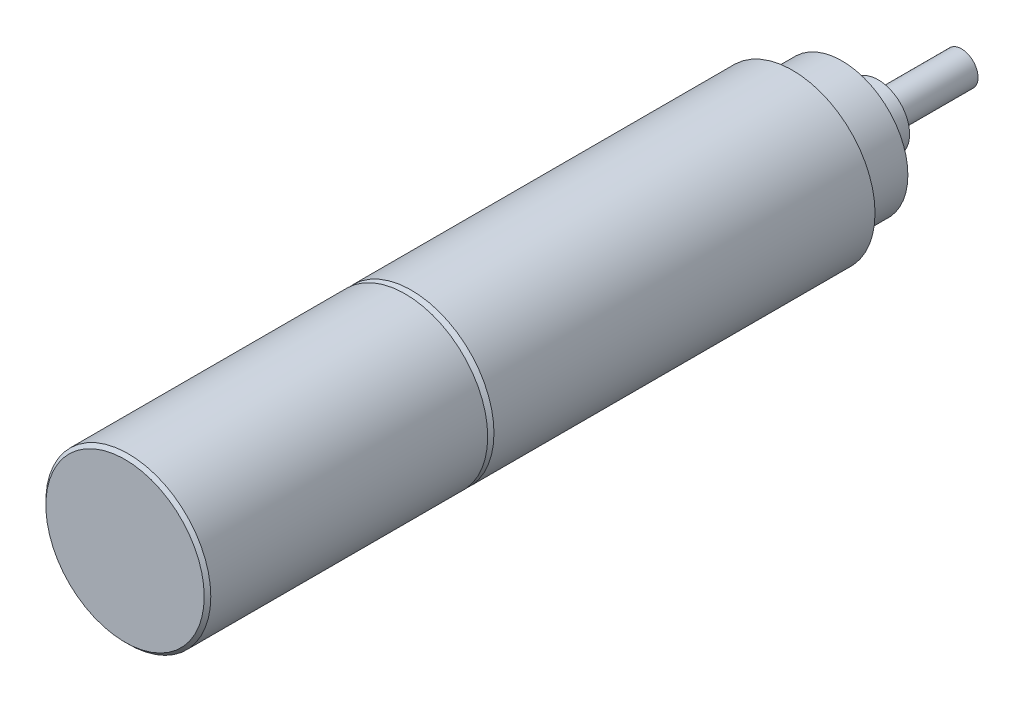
from build123d import *

# Parameters (mm, degrees)
SKETCH1_R      = 5.0038
EXTRUDE1_DEPTH = 23.5
CHAMFER1_SIZE  = 0.381
SKETCH2_R      = 5.0038
EXTRUDE2_DEPTH = 17
SKETCH3_R      = 4.0005
EXTRUDE3_DEPTH = 2.9972
SKETCH5_R      = 1.0033
EXTRUDE4_DEPTH = 10.25
CHAMFER2_SIZE  = 0.2
SKETCH7_R      = 2.5
EXTRUDE6_DEPTH = 1
SKETCH8_R      = 1.8
EXTRUDE7_DEPTH = 1.2
EXTRUDE7_DRAFT = -5


with BuildPart() as part:
    # Sketch1 → Extrude1 (new body)
    with BuildSketch(Plane.XY):
        Circle(SKETCH1_R)
    extrude(amount=EXTRUDE1_DEPTH)

    # Chamfer1
    chamfer1_edges = [part.edges().sort_by_distance(p)[0] for p in [
        (-5.0038, 0, 23.5),
    ]]
    chamfer(chamfer1_edges, length=CHAMFER1_SIZE)

    # Sketch2 → Extrude2 (add)
    with BuildSketch(Plane.XY.offset(23.5)):
        Circle(SKETCH2_R)
    extrude(amount=EXTRUDE2_DEPTH)

    # Sketch3 → Extrude3 (add)
    with BuildSketch(Plane(origin=(0, 0, 0), x_dir=(-1, 0, 0), z_dir=(0, 0, -1))):
        with Locations(Location((0, 0, 0), (0, 0, 180))):
            Circle(SKETCH3_R)
    extrude(amount=EXTRUDE3_DEPTH)

    # Sketch5 → Extrude4 (add)
    with BuildSketch(Plane(origin=(0, 0, 0), x_dir=(-1, 0, 0), z_dir=(0, 0, -1))):
        Circle(SKETCH5_R)
    extrude(amount=EXTRUDE4_DEPTH)

    # Chamfer2
    chamfer2_edges = [part.edges().sort_by_distance(p)[0] for p in [
        (-5.0038, 0, 40.5),
    ]]
    chamfer(chamfer2_edges, length=CHAMFER2_SIZE)

    # Sketch7 → Extrude6 (add)
    with BuildSketch(Plane(origin=(0, 0, -2.9972), x_dir=(-1, 0, 0), z_dir=(0, 0, -1))):
        Circle(SKETCH7_R)
    extrude(amount=EXTRUDE6_DEPTH)


with BuildPart() as extrude7_tool:
    # Sketch8 → Extrude7 (with draft: the straight prism first)
    with BuildSketch(Plane(origin=(0, 0, -3.9972), x_dir=(-1, 0, 0), z_dir=(0, 0, -1))):
        Circle(SKETCH8_R)
    extrude(amount=EXTRUDE7_DEPTH)
    # Extrude7: the draft: its side faces are tilted about the plane it starts from
    extrude7_sides = [extrude7_tool.faces().sort_by_distance(p)[0] for p in [
        (1.8, 0, -4.5972),
    ]]
    draft(extrude7_sides, Plane(origin=(0, 0, -3.9972), x_dir=(-1, 0, 0), z_dir=(0, 0, -1)), EXTRUDE7_DRAFT)


with BuildPart() as part_1:
    add(part.part)

    # Extrude7: add extrude7_tool
    add(extrude7_tool.part)


solid = part_1.part
